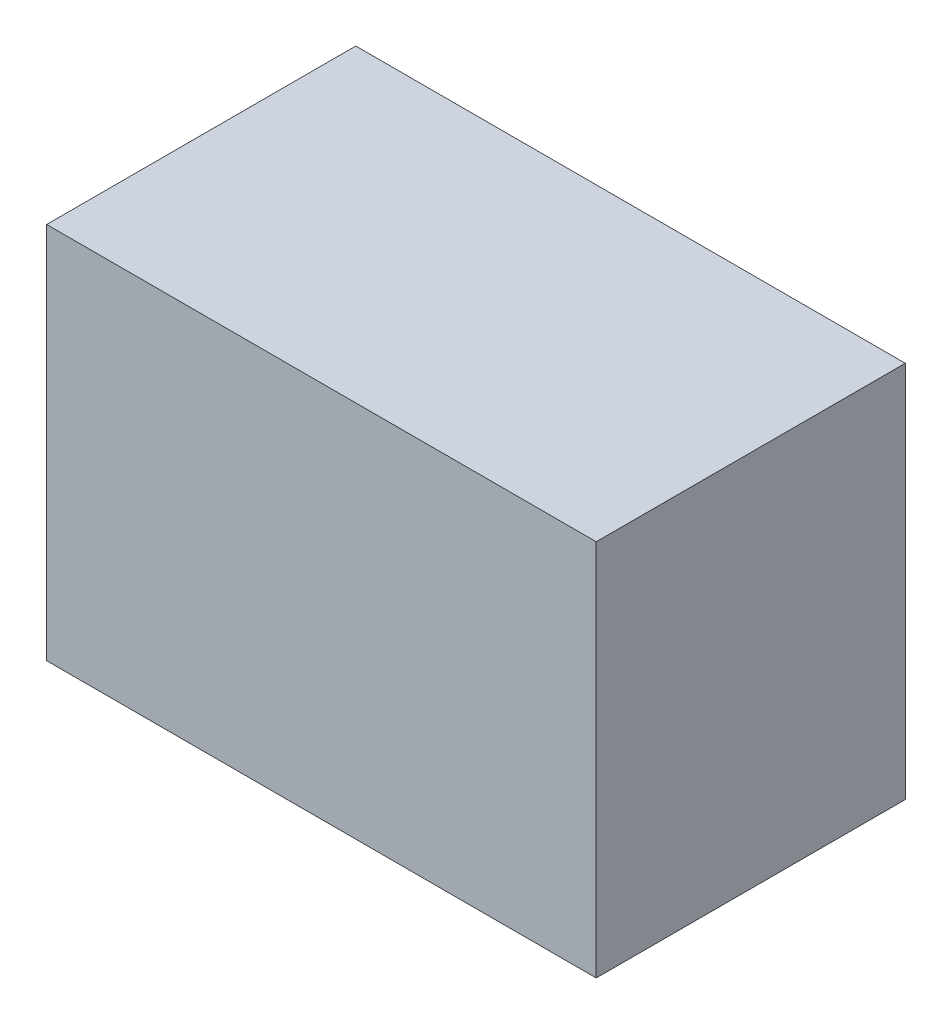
ISO-10303-21;
HEADER;
FILE_DESCRIPTION(('STEP AP214'),'2;1');
FILE_NAME('part.step','',(''),(''),'','','');
FILE_SCHEMA(('AUTOMOTIVE_DESIGN { 1 0 10303 214 1 1 1 1 }'));
ENDSEC;
DATA;
#1=APPLICATION_CONTEXT('core data for automotive mechanical design processes');
#2=APPLICATION_PROTOCOL_DEFINITION('international standard','automotive_design',2000,#1);
#3=PRODUCT_CONTEXT('',#1,'mechanical');
#4=PRODUCT('Part','Part','',(#3));
#5=PRODUCT_RELATED_PRODUCT_CATEGORY('part','',(#4));
#6=PRODUCT_DEFINITION_FORMATION('','',#4);
#7=PRODUCT_DEFINITION_CONTEXT('part definition',#1,'design');
#8=PRODUCT_DEFINITION('design','',#6,#7);
#9=PRODUCT_DEFINITION_SHAPE('','',#8);
#10=(LENGTH_UNIT() NAMED_UNIT(*) SI_UNIT(.MILLI.,.METRE.));
#11=(NAMED_UNIT(*) PLANE_ANGLE_UNIT() SI_UNIT($,.RADIAN.));
#12=(NAMED_UNIT(*) SI_UNIT($,.STERADIAN.) SOLID_ANGLE_UNIT());
#13=UNCERTAINTY_MEASURE_WITH_UNIT(LENGTH_MEASURE(1.E-05),#10,'distance_accuracy_value','');
#14=(GEOMETRIC_REPRESENTATION_CONTEXT(3) GLOBAL_UNCERTAINTY_ASSIGNED_CONTEXT((#13)) GLOBAL_UNIT_ASSIGNED_CONTEXT((#10,
#11,#12)) REPRESENTATION_CONTEXT('',''));
#15=CARTESIAN_POINT('',(0.,0.,0.));
#16=DIRECTION('',(0.,0.,1.));
#17=DIRECTION('',(1.,0.,0.));
#18=AXIS2_PLACEMENT_3D('',#15,#16,#17);
#19=CARTESIAN_POINT('',(0.,0.,180.));
#20=DIRECTION('',(0.,0.,1.));
#21=DIRECTION('',(1.,0.,0.));
#22=AXIS2_PLACEMENT_3D('',#19,#20,#21);
#23=PLANE('',#22);
#24=DIRECTION('',(1.,0.,0.));
#25=VECTOR('',#24,1.);
#26=CARTESIAN_POINT('',(-160.,-110.,180.));
#27=LINE('',#26,#25);
#28=CARTESIAN_POINT('',(-160.,-110.,180.));
#29=VERTEX_POINT('',#28);
#30=CARTESIAN_POINT('',(160.,-110.,180.));
#31=VERTEX_POINT('',#30);
#32=EDGE_CURVE('E81',#29,#31,#27,.T.);
#33=ORIENTED_EDGE('',*,*,#32,.T.);
#34=DIRECTION('',(0.,1.,0.));
#35=VECTOR('',#34,1.);
#36=CARTESIAN_POINT('',(160.,-110.,180.));
#37=LINE('',#36,#35);
#38=CARTESIAN_POINT('',(160.,110.,180.));
#39=VERTEX_POINT('',#38);
#40=EDGE_CURVE('E99',#31,#39,#37,.T.);
#41=ORIENTED_EDGE('',*,*,#40,.T.);
#42=DIRECTION('',(-1.,0.,0.));
#43=VECTOR('',#42,1.);
#44=CARTESIAN_POINT('',(160.,110.,180.));
#45=LINE('',#44,#43);
#46=CARTESIAN_POINT('',(-160.,110.,180.));
#47=VERTEX_POINT('',#46);
#48=EDGE_CURVE('E73',#39,#47,#45,.T.);
#49=ORIENTED_EDGE('',*,*,#48,.T.);
#50=DIRECTION('',(0.,-1.,0.));
#51=VECTOR('',#50,1.);
#52=CARTESIAN_POINT('',(-160.,110.,180.));
#53=LINE('',#52,#51);
#54=EDGE_CURVE('E10',#47,#29,#53,.T.);
#55=ORIENTED_EDGE('',*,*,#54,.T.);
#56=EDGE_LOOP('',(#33,#41,#49,#55));
#57=FACE_BOUND('',#56,.T.);
#58=ADVANCED_FACE('F16',(#57),#23,.T.);
#59=CARTESIAN_POINT('',(0.,0.,0.));
#60=DIRECTION('',(0.,0.,1.));
#61=DIRECTION('',(1.,0.,0.));
#62=AXIS2_PLACEMENT_3D('',#59,#60,#61);
#63=PLANE('',#62);
#64=DIRECTION('',(0.,-1.,0.));
#65=VECTOR('',#64,1.);
#66=CARTESIAN_POINT('',(-160.,110.,0.));
#67=LINE('',#66,#65);
#68=CARTESIAN_POINT('',(-160.,110.,0.));
#69=VERTEX_POINT('',#68);
#70=CARTESIAN_POINT('',(-160.,-110.,0.));
#71=VERTEX_POINT('',#70);
#72=EDGE_CURVE('E24',#69,#71,#67,.T.);
#73=ORIENTED_EDGE('',*,*,#72,.F.);
#74=DIRECTION('',(-1.,0.,0.));
#75=VECTOR('',#74,1.);
#76=CARTESIAN_POINT('',(160.,110.,0.));
#77=LINE('',#76,#75);
#78=CARTESIAN_POINT('',(160.,110.,0.));
#79=VERTEX_POINT('',#78);
#80=EDGE_CURVE('E103',#79,#69,#77,.T.);
#81=ORIENTED_EDGE('',*,*,#80,.F.);
#82=DIRECTION('',(0.,1.,0.));
#83=VECTOR('',#82,1.);
#84=CARTESIAN_POINT('',(160.,-110.,0.));
#85=LINE('',#84,#83);
#86=CARTESIAN_POINT('',(160.,-110.,0.));
#87=VERTEX_POINT('',#86);
#88=EDGE_CURVE('E83',#87,#79,#85,.T.);
#89=ORIENTED_EDGE('',*,*,#88,.F.);
#90=DIRECTION('',(1.,0.,0.));
#91=VECTOR('',#90,1.);
#92=CARTESIAN_POINT('',(-160.,-110.,0.));
#93=LINE('',#92,#91);
#94=EDGE_CURVE('E79',#71,#87,#93,.T.);
#95=ORIENTED_EDGE('',*,*,#94,.F.);
#96=EDGE_LOOP('',(#73,#81,#89,#95));
#97=FACE_BOUND('',#96,.T.);
#98=ADVANCED_FACE('F85',(#97),#63,.F.);
#99=CARTESIAN_POINT('',(-160.,110.,0.));
#100=DIRECTION('',(1.,0.,0.));
#101=DIRECTION('',(0.,1.,0.));
#102=AXIS2_PLACEMENT_3D('',#99,#100,#101);
#103=PLANE('',#102);
#104=ORIENTED_EDGE('',*,*,#72,.T.);
#105=DIRECTION('',(0.,0.,1.));
#106=VECTOR('',#105,1.);
#107=CARTESIAN_POINT('',(-160.,-110.,0.));
#108=LINE('',#107,#106);
#109=EDGE_CURVE('E67',#71,#29,#108,.T.);
#110=ORIENTED_EDGE('',*,*,#109,.T.);
#111=ORIENTED_EDGE('',*,*,#54,.F.);
#112=DIRECTION('',(0.,0.,1.));
#113=VECTOR('',#112,1.);
#114=CARTESIAN_POINT('',(-160.,110.,0.));
#115=LINE('',#114,#113);
#116=EDGE_CURVE('E70',#69,#47,#115,.T.);
#117=ORIENTED_EDGE('',*,*,#116,.F.);
#118=EDGE_LOOP('',(#104,#110,#111,#117));
#119=FACE_BOUND('',#118,.T.);
#120=ADVANCED_FACE('F66',(#119),#103,.F.);
#121=CARTESIAN_POINT('',(160.,110.,0.));
#122=DIRECTION('',(0.,-1.,0.));
#123=DIRECTION('',(0.,0.,-1.));
#124=AXIS2_PLACEMENT_3D('',#121,#122,#123);
#125=PLANE('',#124);
#126=ORIENTED_EDGE('',*,*,#80,.T.);
#127=ORIENTED_EDGE('',*,*,#116,.T.);
#128=ORIENTED_EDGE('',*,*,#48,.F.);
#129=DIRECTION('',(0.,0.,1.));
#130=VECTOR('',#129,1.);
#131=CARTESIAN_POINT('',(160.,110.,0.));
#132=LINE('',#131,#130);
#133=EDGE_CURVE('E104',#79,#39,#132,.T.);
#134=ORIENTED_EDGE('',*,*,#133,.F.);
#135=EDGE_LOOP('',(#126,#127,#128,#134));
#136=FACE_BOUND('',#135,.T.);
#137=ADVANCED_FACE('F117',(#136),#125,.F.);
#138=CARTESIAN_POINT('',(160.,-110.,0.));
#139=DIRECTION('',(-1.,0.,0.));
#140=DIRECTION('',(0.,0.,1.));
#141=AXIS2_PLACEMENT_3D('',#138,#139,#140);
#142=PLANE('',#141);
#143=ORIENTED_EDGE('',*,*,#88,.T.);
#144=ORIENTED_EDGE('',*,*,#133,.T.);
#145=ORIENTED_EDGE('',*,*,#40,.F.);
#146=DIRECTION('',(0.,0.,1.));
#147=VECTOR('',#146,1.);
#148=CARTESIAN_POINT('',(160.,-110.,0.));
#149=LINE('',#148,#147);
#150=EDGE_CURVE('E89',#87,#31,#149,.T.);
#151=ORIENTED_EDGE('',*,*,#150,.F.);
#152=EDGE_LOOP('',(#143,#144,#145,#151));
#153=FACE_BOUND('',#152,.T.);
#154=ADVANCED_FACE('F119',(#153),#142,.F.);
#155=CARTESIAN_POINT('',(-160.,-110.,0.));
#156=DIRECTION('',(0.,1.,0.));
#157=DIRECTION('',(1.,0.,0.));
#158=AXIS2_PLACEMENT_3D('',#155,#156,#157);
#159=PLANE('',#158);
#160=ORIENTED_EDGE('',*,*,#94,.T.);
#161=ORIENTED_EDGE('',*,*,#150,.T.);
#162=ORIENTED_EDGE('',*,*,#32,.F.);
#163=ORIENTED_EDGE('',*,*,#109,.F.);
#164=EDGE_LOOP('',(#160,#161,#162,#163));
#165=FACE_BOUND('',#164,.T.);
#166=ADVANCED_FACE('F77',(#165),#159,.F.);
#167=CLOSED_SHELL('',(#58,#98,#120,#137,#154,#166));
#168=MANIFOLD_SOLID_BREP('B1',#167);
#169=ADVANCED_BREP_SHAPE_REPRESENTATION('',(#18,#168),#14);
#170=SHAPE_DEFINITION_REPRESENTATION(#9,#169);
ENDSEC;
END-ISO-10303-21;
